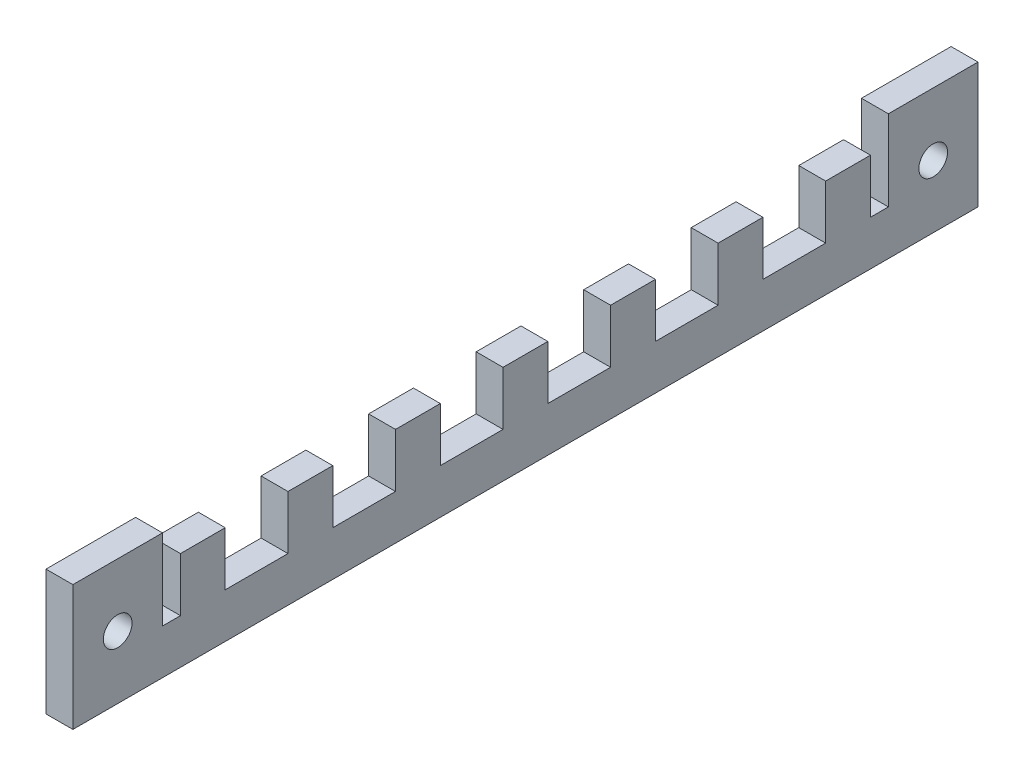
ISO-10303-21;
HEADER;
FILE_DESCRIPTION(('STEP AP214'),'2;1');
FILE_NAME('part.step','',(''),(''),'','','');
FILE_SCHEMA(('AUTOMOTIVE_DESIGN { 1 0 10303 214 1 1 1 1 }'));
ENDSEC;
DATA;
#1=APPLICATION_CONTEXT('core data for automotive mechanical design processes');
#2=APPLICATION_PROTOCOL_DEFINITION('international standard','automotive_design',2000,#1);
#3=PRODUCT_CONTEXT('',#1,'mechanical');
#4=PRODUCT('Part','Part','',(#3));
#5=PRODUCT_RELATED_PRODUCT_CATEGORY('part','',(#4));
#6=PRODUCT_DEFINITION_FORMATION('','',#4);
#7=PRODUCT_DEFINITION_CONTEXT('part definition',#1,'design');
#8=PRODUCT_DEFINITION('design','',#6,#7);
#9=PRODUCT_DEFINITION_SHAPE('','',#8);
#10=(LENGTH_UNIT() NAMED_UNIT(*) SI_UNIT(.MILLI.,.METRE.));
#11=(NAMED_UNIT(*) PLANE_ANGLE_UNIT() SI_UNIT($,.RADIAN.));
#12=(NAMED_UNIT(*) SI_UNIT($,.STERADIAN.) SOLID_ANGLE_UNIT());
#13=UNCERTAINTY_MEASURE_WITH_UNIT(LENGTH_MEASURE(1.E-05),#10,'distance_accuracy_value','');
#14=(GEOMETRIC_REPRESENTATION_CONTEXT(3) GLOBAL_UNCERTAINTY_ASSIGNED_CONTEXT((#13)) GLOBAL_UNIT_ASSIGNED_CONTEXT((#10,
#11,#12)) REPRESENTATION_CONTEXT('',''));
#15=CARTESIAN_POINT('',(0.,0.,0.));
#16=DIRECTION('',(0.,0.,1.));
#17=DIRECTION('',(1.,0.,0.));
#18=AXIS2_PLACEMENT_3D('',#15,#16,#17);
#19=CARTESIAN_POINT('',(22.5,24.4814087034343,-50.51));
#20=DIRECTION('',(-1.,0.,0.));
#21=DIRECTION('',(0.,0.,1.));
#22=AXIS2_PLACEMENT_3D('',#19,#20,#21);
#23=PLANE('',#22);
#24=CARTESIAN_POINT('',(22.5,7.,45.5));
#25=DIRECTION('',(-1.,0.,0.));
#26=DIRECTION('',(0.,0.,1.));
#27=AXIS2_PLACEMENT_3D('',#24,#25,#26);
#28=CIRCLE('',#27,1.6);
#29=CARTESIAN_POINT('',(22.5,7.,47.1));
#30=VERTEX_POINT('',#29);
#31=EDGE_CURVE('E404',#30,#30,#28,.F.);
#32=ORIENTED_EDGE('',*,*,#31,.F.);
#33=EDGE_LOOP('',(#32));
#34=FACE_BOUND('',#33,.T.);
#35=DIRECTION('',(0.,1.,0.));
#36=VECTOR('',#35,1.);
#37=CARTESIAN_POINT('',(22.5,14.,50.5));
#38=LINE('',#37,#36);
#39=CARTESIAN_POINT('',(22.5,0.,50.5));
#40=VERTEX_POINT('',#39);
#41=CARTESIAN_POINT('',(22.5,14.,50.5));
#42=VERTEX_POINT('',#41);
#43=EDGE_CURVE('E395',#40,#42,#38,.T.);
#44=ORIENTED_EDGE('',*,*,#43,.F.);
#45=DIRECTION('',(0.,0.,-1.));
#46=VECTOR('',#45,1.);
#47=CARTESIAN_POINT('',(22.5,0.,0.));
#48=LINE('',#47,#46);
#49=CARTESIAN_POINT('',(22.5,0.,-50.5));
#50=VERTEX_POINT('',#49);
#51=EDGE_CURVE('E386',#40,#50,#48,.T.);
#52=ORIENTED_EDGE('',*,*,#51,.T.);
#53=DIRECTION('',(0.,-1.,0.));
#54=VECTOR('',#53,1.);
#55=CARTESIAN_POINT('',(22.5,14.,-50.5));
#56=LINE('',#55,#54);
#57=CARTESIAN_POINT('',(22.5,14.,-50.5));
#58=VERTEX_POINT('',#57);
#59=EDGE_CURVE('E398',#58,#50,#56,.T.);
#60=ORIENTED_EDGE('',*,*,#59,.F.);
#61=DIRECTION('',(0.,0.,-1.));
#62=VECTOR('',#61,1.);
#63=CARTESIAN_POINT('',(22.5,14.,0.));
#64=LINE('',#63,#62);
#65=CARTESIAN_POINT('',(22.5,14.,-40.5));
#66=VERTEX_POINT('',#65);
#67=EDGE_CURVE('E393',#66,#58,#64,.T.);
#68=ORIENTED_EDGE('',*,*,#67,.F.);
#69=DIRECTION('',(0.,-1.,0.));
#70=VECTOR('',#69,1.);
#71=CARTESIAN_POINT('',(22.5,-4.,-40.5));
#72=LINE('',#71,#70);
#73=CARTESIAN_POINT('',(22.5,5.,-40.5));
#74=VERTEX_POINT('',#73);
#75=EDGE_CURVE('E353',#66,#74,#72,.T.);
#76=ORIENTED_EDGE('',*,*,#75,.T.);
#77=DIRECTION('',(0.,0.,-1.));
#78=VECTOR('',#77,1.);
#79=CARTESIAN_POINT('',(22.5,5.,-40.5));
#80=LINE('',#79,#78);
#81=CARTESIAN_POINT('',(22.5,5.,-38.5));
#82=VERTEX_POINT('',#81);
#83=EDGE_CURVE('E408',#82,#74,#80,.T.);
#84=ORIENTED_EDGE('',*,*,#83,.F.);
#85=DIRECTION('',(0.,1.,0.));
#86=VECTOR('',#85,1.);
#87=CARTESIAN_POINT('',(22.5,11.,-38.5));
#88=LINE('',#87,#86);
#89=CARTESIAN_POINT('',(22.5,11.,-38.5));
#90=VERTEX_POINT('',#89);
#91=EDGE_CURVE('E356',#82,#90,#88,.T.);
#92=ORIENTED_EDGE('',*,*,#91,.T.);
#93=DIRECTION('',(0.,0.,1.));
#94=VECTOR('',#93,1.);
#95=CARTESIAN_POINT('',(22.5,11.,-40.5));
#96=LINE('',#95,#94);
#97=CARTESIAN_POINT('',(22.5,11.,-33.5));
#98=VERTEX_POINT('',#97);
#99=EDGE_CURVE('E331',#90,#98,#96,.T.);
#100=ORIENTED_EDGE('',*,*,#99,.T.);
#101=DIRECTION('',(0.,-1.,0.));
#102=VECTOR('',#101,1.);
#103=CARTESIAN_POINT('',(22.5,11.,-33.5));
#104=LINE('',#103,#102);
#105=CARTESIAN_POINT('',(22.5,5.,-33.5));
#106=VERTEX_POINT('',#105);
#107=EDGE_CURVE('E359',#98,#106,#104,.T.);
#108=ORIENTED_EDGE('',*,*,#107,.T.);
#109=DIRECTION('',(0.,0.,1.));
#110=VECTOR('',#109,1.);
#111=CARTESIAN_POINT('',(22.5,5.,-38.5));
#112=LINE('',#111,#110);
#113=CARTESIAN_POINT('',(22.5,5.,-26.5));
#114=VERTEX_POINT('',#113);
#115=EDGE_CURVE('E318',#106,#114,#112,.T.);
#116=ORIENTED_EDGE('',*,*,#115,.T.);
#117=DIRECTION('',(0.,1.,0.));
#118=VECTOR('',#117,1.);
#119=CARTESIAN_POINT('',(22.5,11.,-26.5));
#120=LINE('',#119,#118);
#121=CARTESIAN_POINT('',(22.5,11.,-26.5));
#122=VERTEX_POINT('',#121);
#123=EDGE_CURVE('E363',#114,#122,#120,.T.);
#124=ORIENTED_EDGE('',*,*,#123,.T.);
#125=DIRECTION('',(0.,0.,1.));
#126=VECTOR('',#125,1.);
#127=CARTESIAN_POINT('',(22.5,11.,-28.5));
#128=LINE('',#127,#126);
#129=CARTESIAN_POINT('',(22.5,11.,-21.5));
#130=VERTEX_POINT('',#129);
#131=EDGE_CURVE('E334',#122,#130,#128,.T.);
#132=ORIENTED_EDGE('',*,*,#131,.T.);
#133=DIRECTION('',(0.,-1.,0.));
#134=VECTOR('',#133,1.);
#135=CARTESIAN_POINT('',(22.5,11.,-21.5));
#136=LINE('',#135,#134);
#137=CARTESIAN_POINT('',(22.5,5.,-21.5));
#138=VERTEX_POINT('',#137);
#139=EDGE_CURVE('E361',#130,#138,#136,.T.);
#140=ORIENTED_EDGE('',*,*,#139,.T.);
#141=DIRECTION('',(0.,0.,1.));
#142=VECTOR('',#141,1.);
#143=CARTESIAN_POINT('',(22.5,5.,-38.5));
#144=LINE('',#143,#142);
#145=CARTESIAN_POINT('',(22.5,5.,-14.5));
#146=VERTEX_POINT('',#145);
#147=EDGE_CURVE('E290',#138,#146,#144,.T.);
#148=ORIENTED_EDGE('',*,*,#147,.T.);
#149=DIRECTION('',(0.,1.,0.));
#150=VECTOR('',#149,1.);
#151=CARTESIAN_POINT('',(22.5,11.,-14.5));
#152=LINE('',#151,#150);
#153=CARTESIAN_POINT('',(22.5,11.,-14.5));
#154=VERTEX_POINT('',#153);
#155=EDGE_CURVE('E367',#146,#154,#152,.T.);
#156=ORIENTED_EDGE('',*,*,#155,.T.);
#157=DIRECTION('',(0.,0.,1.));
#158=VECTOR('',#157,1.);
#159=CARTESIAN_POINT('',(22.5,11.,-16.5));
#160=LINE('',#159,#158);
#161=CARTESIAN_POINT('',(22.5,11.,-9.5));
#162=VERTEX_POINT('',#161);
#163=EDGE_CURVE('E337',#154,#162,#160,.T.);
#164=ORIENTED_EDGE('',*,*,#163,.T.);
#165=DIRECTION('',(0.,-1.,0.));
#166=VECTOR('',#165,1.);
#167=CARTESIAN_POINT('',(22.5,11.,-9.5));
#168=LINE('',#167,#166);
#169=CARTESIAN_POINT('',(22.5,5.,-9.5));
#170=VERTEX_POINT('',#169);
#171=EDGE_CURVE('E285',#162,#170,#168,.T.);
#172=ORIENTED_EDGE('',*,*,#171,.T.);
#173=DIRECTION('',(0.,0.,1.));
#174=VECTOR('',#173,1.);
#175=CARTESIAN_POINT('',(22.5,5.,-38.5));
#176=LINE('',#175,#174);
#177=CARTESIAN_POINT('',(22.5,5.,-2.49999999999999));
#178=VERTEX_POINT('',#177);
#179=EDGE_CURVE('E281',#170,#178,#176,.T.);
#180=ORIENTED_EDGE('',*,*,#179,.T.);
#181=DIRECTION('',(0.,1.,0.));
#182=VECTOR('',#181,1.);
#183=CARTESIAN_POINT('',(22.5,11.,-2.49999999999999));
#184=LINE('',#183,#182);
#185=CARTESIAN_POINT('',(22.5,11.,-2.49999999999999));
#186=VERTEX_POINT('',#185);
#187=EDGE_CURVE('E267',#178,#186,#184,.T.);
#188=ORIENTED_EDGE('',*,*,#187,.T.);
#189=DIRECTION('',(0.,0.,1.));
#190=VECTOR('',#189,1.);
#191=CARTESIAN_POINT('',(22.5,11.,-4.49999999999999));
#192=LINE('',#191,#190);
#193=CARTESIAN_POINT('',(22.5,11.,2.5));
#194=VERTEX_POINT('',#193);
#195=EDGE_CURVE('E339',#186,#194,#192,.T.);
#196=ORIENTED_EDGE('',*,*,#195,.T.);
#197=DIRECTION('',(0.,-1.,0.));
#198=VECTOR('',#197,1.);
#199=CARTESIAN_POINT('',(22.5,11.,2.5));
#200=LINE('',#199,#198);
#201=CARTESIAN_POINT('',(22.5,5.,2.5));
#202=VERTEX_POINT('',#201);
#203=EDGE_CURVE('E278',#194,#202,#200,.T.);
#204=ORIENTED_EDGE('',*,*,#203,.T.);
#205=DIRECTION('',(0.,0.,1.));
#206=VECTOR('',#205,1.);
#207=CARTESIAN_POINT('',(22.5,5.,-38.5));
#208=LINE('',#207,#206);
#209=CARTESIAN_POINT('',(22.5,5.,9.50000000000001));
#210=VERTEX_POINT('',#209);
#211=EDGE_CURVE('E289',#202,#210,#208,.T.);
#212=ORIENTED_EDGE('',*,*,#211,.T.);
#213=DIRECTION('',(0.,1.,0.));
#214=VECTOR('',#213,1.);
#215=CARTESIAN_POINT('',(22.5,11.,9.50000000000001));
#216=LINE('',#215,#214);
#217=CARTESIAN_POINT('',(22.5,11.,9.50000000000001));
#218=VERTEX_POINT('',#217);
#219=EDGE_CURVE('E372',#210,#218,#216,.T.);
#220=ORIENTED_EDGE('',*,*,#219,.T.);
#221=DIRECTION('',(0.,0.,1.));
#222=VECTOR('',#221,1.);
#223=CARTESIAN_POINT('',(22.5,11.,7.50000000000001));
#224=LINE('',#223,#222);
#225=CARTESIAN_POINT('',(22.5,11.,14.5));
#226=VERTEX_POINT('',#225);
#227=EDGE_CURVE('E341',#218,#226,#224,.T.);
#228=ORIENTED_EDGE('',*,*,#227,.T.);
#229=DIRECTION('',(0.,-1.,0.));
#230=VECTOR('',#229,1.);
#231=CARTESIAN_POINT('',(22.5,11.,14.5));
#232=LINE('',#231,#230);
#233=CARTESIAN_POINT('',(22.5,5.,14.5));
#234=VERTEX_POINT('',#233);
#235=EDGE_CURVE('E277',#226,#234,#232,.T.);
#236=ORIENTED_EDGE('',*,*,#235,.T.);
#237=DIRECTION('',(0.,0.,1.));
#238=VECTOR('',#237,1.);
#239=CARTESIAN_POINT('',(22.5,5.,-38.5));
#240=LINE('',#239,#238);
#241=CARTESIAN_POINT('',(22.5,5.,21.5));
#242=VERTEX_POINT('',#241);
#243=EDGE_CURVE('E325',#234,#242,#240,.T.);
#244=ORIENTED_EDGE('',*,*,#243,.T.);
#245=DIRECTION('',(0.,1.,0.));
#246=VECTOR('',#245,1.);
#247=CARTESIAN_POINT('',(22.5,11.,21.5));
#248=LINE('',#247,#246);
#249=CARTESIAN_POINT('',(22.5,11.,21.5));
#250=VERTEX_POINT('',#249);
#251=EDGE_CURVE('E377',#242,#250,#248,.T.);
#252=ORIENTED_EDGE('',*,*,#251,.T.);
#253=DIRECTION('',(0.,0.,1.));
#254=VECTOR('',#253,1.);
#255=CARTESIAN_POINT('',(22.5,11.,19.5));
#256=LINE('',#255,#254);
#257=CARTESIAN_POINT('',(22.5,11.,26.5));
#258=VERTEX_POINT('',#257);
#259=EDGE_CURVE('E344',#250,#258,#256,.T.);
#260=ORIENTED_EDGE('',*,*,#259,.T.);
#261=DIRECTION('',(0.,-1.,0.));
#262=VECTOR('',#261,1.);
#263=CARTESIAN_POINT('',(22.5,11.,26.5));
#264=LINE('',#263,#262);
#265=CARTESIAN_POINT('',(22.5,5.,26.5));
#266=VERTEX_POINT('',#265);
#267=EDGE_CURVE('E375',#258,#266,#264,.T.);
#268=ORIENTED_EDGE('',*,*,#267,.T.);
#269=DIRECTION('',(0.,0.,1.));
#270=VECTOR('',#269,1.);
#271=CARTESIAN_POINT('',(22.5,5.,-38.5));
#272=LINE('',#271,#270);
#273=CARTESIAN_POINT('',(22.5,5.,33.5));
#274=VERTEX_POINT('',#273);
#275=EDGE_CURVE('E328',#266,#274,#272,.T.);
#276=ORIENTED_EDGE('',*,*,#275,.T.);
#277=DIRECTION('',(0.,1.,0.));
#278=VECTOR('',#277,1.);
#279=CARTESIAN_POINT('',(22.5,11.,33.5));
#280=LINE('',#279,#278);
#281=CARTESIAN_POINT('',(22.5,11.,33.5));
#282=VERTEX_POINT('',#281);
#283=EDGE_CURVE('E383',#274,#282,#280,.T.);
#284=ORIENTED_EDGE('',*,*,#283,.T.);
#285=DIRECTION('',(0.,0.,1.));
#286=VECTOR('',#285,1.);
#287=CARTESIAN_POINT('',(22.5,11.,31.5));
#288=LINE('',#287,#286);
#289=CARTESIAN_POINT('',(22.5,11.,38.5));
#290=VERTEX_POINT('',#289);
#291=EDGE_CURVE('E347',#282,#290,#288,.T.);
#292=ORIENTED_EDGE('',*,*,#291,.T.);
#293=DIRECTION('',(0.,-1.,0.));
#294=VECTOR('',#293,1.);
#295=CARTESIAN_POINT('',(22.5,11.,38.5));
#296=LINE('',#295,#294);
#297=CARTESIAN_POINT('',(22.5,5.,38.5));
#298=VERTEX_POINT('',#297);
#299=EDGE_CURVE('E380',#290,#298,#296,.T.);
#300=ORIENTED_EDGE('',*,*,#299,.T.);
#301=CARTESIAN_POINT('',(22.5,5.,40.5));
#302=VERTEX_POINT('',#301);
#303=EDGE_CURVE('E407',#302,#298,#80,.T.);
#304=ORIENTED_EDGE('',*,*,#303,.F.);
#305=DIRECTION('',(0.,1.,0.));
#306=VECTOR('',#305,1.);
#307=CARTESIAN_POINT('',(22.5,-4.,40.5));
#308=LINE('',#307,#306);
#309=CARTESIAN_POINT('',(22.5,14.,40.5));
#310=VERTEX_POINT('',#309);
#311=EDGE_CURVE('E350',#302,#310,#308,.T.);
#312=ORIENTED_EDGE('',*,*,#311,.T.);
#313=EDGE_CURVE('E391',#42,#310,#64,.T.);
#314=ORIENTED_EDGE('',*,*,#313,.F.);
#315=EDGE_LOOP('',(#44,#52,#60,#68,#76,#84,#92,#100,#108,#116,#124,#132,#140,#148,#156,#164,
#172,#180,#188,#196,#204,#212,#220,#228,#236,#244,#252,#260,#268,#276,#284,#292,#300,#304,#312,#314));
#316=FACE_BOUND('',#315,.T.);
#317=CARTESIAN_POINT('',(22.5,7.,-45.5));
#318=DIRECTION('',(-1.,0.,0.));
#319=DIRECTION('',(0.,0.,1.));
#320=AXIS2_PLACEMENT_3D('',#317,#318,#319);
#321=CIRCLE('',#320,1.6);
#322=CARTESIAN_POINT('',(22.5,7.,-43.9));
#323=VERTEX_POINT('',#322);
#324=EDGE_CURVE('E401',#323,#323,#321,.F.);
#325=ORIENTED_EDGE('',*,*,#324,.F.);
#326=EDGE_LOOP('',(#325));
#327=FACE_BOUND('',#326,.T.);
#328=ADVANCED_FACE('F32',(#34,#316,#327),#23,.F.);
#329=CARTESIAN_POINT('',(19.5,24.4814087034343,-50.51));
#330=DIRECTION('',(-1.,0.,0.));
#331=DIRECTION('',(0.,0.,1.));
#332=AXIS2_PLACEMENT_3D('',#329,#330,#331);
#333=PLANE('',#332);
#334=CARTESIAN_POINT('',(19.5,7.,-45.5));
#335=DIRECTION('',(-1.,0.,0.));
#336=DIRECTION('',(0.,0.,1.));
#337=AXIS2_PLACEMENT_3D('',#334,#335,#336);
#338=CIRCLE('',#337,1.6);
#339=CARTESIAN_POINT('',(19.5,7.,-43.9));
#340=VERTEX_POINT('',#339);
#341=EDGE_CURVE('E390',#340,#340,#338,.F.);
#342=ORIENTED_EDGE('',*,*,#341,.T.);
#343=EDGE_LOOP('',(#342));
#344=FACE_BOUND('',#343,.T.);
#345=DIRECTION('',(0.,1.,0.));
#346=VECTOR('',#345,1.);
#347=CARTESIAN_POINT('',(19.5,14.,50.5));
#348=LINE('',#347,#346);
#349=CARTESIAN_POINT('',(19.5,0.,50.5));
#350=VERTEX_POINT('',#349);
#351=CARTESIAN_POINT('',(19.5,14.,50.5));
#352=VERTEX_POINT('',#351);
#353=EDGE_CURVE('E487',#350,#352,#348,.T.);
#354=ORIENTED_EDGE('',*,*,#353,.T.);
#355=DIRECTION('',(0.,0.,-1.));
#356=VECTOR('',#355,1.);
#357=CARTESIAN_POINT('',(19.5,14.,0.));
#358=LINE('',#357,#356);
#359=CARTESIAN_POINT('',(19.5,14.,40.5));
#360=VERTEX_POINT('',#359);
#361=EDGE_CURVE('E394',#352,#360,#358,.T.);
#362=ORIENTED_EDGE('',*,*,#361,.T.);
#363=DIRECTION('',(0.,1.,0.));
#364=VECTOR('',#363,1.);
#365=CARTESIAN_POINT('',(19.5,-4.,40.5));
#366=LINE('',#365,#364);
#367=CARTESIAN_POINT('',(19.5,5.,40.5));
#368=VERTEX_POINT('',#367);
#369=EDGE_CURVE('E574',#368,#360,#366,.T.);
#370=ORIENTED_EDGE('',*,*,#369,.F.);
#371=DIRECTION('',(0.,0.,-1.));
#372=VECTOR('',#371,1.);
#373=CARTESIAN_POINT('',(19.5,5.,-40.5));
#374=LINE('',#373,#372);
#375=CARTESIAN_POINT('',(19.5,5.,38.5));
#376=VERTEX_POINT('',#375);
#377=EDGE_CURVE('E495',#368,#376,#374,.T.);
#378=ORIENTED_EDGE('',*,*,#377,.T.);
#379=DIRECTION('',(0.,-1.,0.));
#380=VECTOR('',#379,1.);
#381=CARTESIAN_POINT('',(19.5,11.,38.5));
#382=LINE('',#381,#380);
#383=CARTESIAN_POINT('',(19.5,11.,38.5));
#384=VERTEX_POINT('',#383);
#385=EDGE_CURVE('E630',#384,#376,#382,.T.);
#386=ORIENTED_EDGE('',*,*,#385,.F.);
#387=DIRECTION('',(0.,0.,1.));
#388=VECTOR('',#387,1.);
#389=CARTESIAN_POINT('',(19.5,11.,31.5));
#390=LINE('',#389,#388);
#391=CARTESIAN_POINT('',(19.5,11.,33.5));
#392=VERTEX_POINT('',#391);
#393=EDGE_CURVE('E548',#392,#384,#390,.T.);
#394=ORIENTED_EDGE('',*,*,#393,.F.);
#395=DIRECTION('',(0.,1.,0.));
#396=VECTOR('',#395,1.);
#397=CARTESIAN_POINT('',(19.5,11.,33.5));
#398=LINE('',#397,#396);
#399=CARTESIAN_POINT('',(19.5,5.,33.5));
#400=VERTEX_POINT('',#399);
#401=EDGE_CURVE('E631',#400,#392,#398,.T.);
#402=ORIENTED_EDGE('',*,*,#401,.F.);
#403=CARTESIAN_POINT('',(19.5,5.,26.5));
#404=VERTEX_POINT('',#403);
#405=EDGE_CURVE('E499',#400,#404,#374,.T.);
#406=ORIENTED_EDGE('',*,*,#405,.T.);
#407=DIRECTION('',(0.,-1.,0.));
#408=VECTOR('',#407,1.);
#409=CARTESIAN_POINT('',(19.5,11.,26.5));
#410=LINE('',#409,#408);
#411=CARTESIAN_POINT('',(19.5,11.,26.5));
#412=VERTEX_POINT('',#411);
#413=EDGE_CURVE('E553',#412,#404,#410,.T.);
#414=ORIENTED_EDGE('',*,*,#413,.F.);
#415=DIRECTION('',(0.,0.,1.));
#416=VECTOR('',#415,1.);
#417=CARTESIAN_POINT('',(19.5,11.,19.5));
#418=LINE('',#417,#416);
#419=CARTESIAN_POINT('',(19.5,11.,21.5));
#420=VERTEX_POINT('',#419);
#421=EDGE_CURVE('E544',#420,#412,#418,.T.);
#422=ORIENTED_EDGE('',*,*,#421,.F.);
#423=DIRECTION('',(0.,1.,0.));
#424=VECTOR('',#423,1.);
#425=CARTESIAN_POINT('',(19.5,11.,21.5));
#426=LINE('',#425,#424);
#427=CARTESIAN_POINT('',(19.5,5.,21.5));
#428=VERTEX_POINT('',#427);
#429=EDGE_CURVE('E526',#428,#420,#426,.T.);
#430=ORIENTED_EDGE('',*,*,#429,.F.);
#431=CARTESIAN_POINT('',(19.5,5.,14.5));
#432=VERTEX_POINT('',#431);
#433=EDGE_CURVE('E503',#428,#432,#374,.T.);
#434=ORIENTED_EDGE('',*,*,#433,.T.);
#435=DIRECTION('',(0.,-1.,0.));
#436=VECTOR('',#435,1.);
#437=CARTESIAN_POINT('',(19.5,11.,14.5));
#438=LINE('',#437,#436);
#439=CARTESIAN_POINT('',(19.5,11.,14.5));
#440=VERTEX_POINT('',#439);
#441=EDGE_CURVE('E524',#440,#432,#438,.T.);
#442=ORIENTED_EDGE('',*,*,#441,.F.);
#443=DIRECTION('',(0.,0.,1.));
#444=VECTOR('',#443,1.);
#445=CARTESIAN_POINT('',(19.5,11.,7.50000000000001));
#446=LINE('',#445,#444);
#447=CARTESIAN_POINT('',(19.5,11.,9.50000000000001));
#448=VERTEX_POINT('',#447);
#449=EDGE_CURVE('E541',#448,#440,#446,.T.);
#450=ORIENTED_EDGE('',*,*,#449,.F.);
#451=DIRECTION('',(0.,1.,0.));
#452=VECTOR('',#451,1.);
#453=CARTESIAN_POINT('',(19.5,11.,9.50000000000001));
#454=LINE('',#453,#452);
#455=CARTESIAN_POINT('',(19.5,5.,9.50000000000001));
#456=VERTEX_POINT('',#455);
#457=EDGE_CURVE('E534',#456,#448,#454,.T.);
#458=ORIENTED_EDGE('',*,*,#457,.F.);
#459=CARTESIAN_POINT('',(19.5,5.,2.5));
#460=VERTEX_POINT('',#459);
#461=EDGE_CURVE('E514',#456,#460,#374,.T.);
#462=ORIENTED_EDGE('',*,*,#461,.T.);
#463=DIRECTION('',(0.,-1.,0.));
#464=VECTOR('',#463,1.);
#465=CARTESIAN_POINT('',(19.5,11.,2.5));
#466=LINE('',#465,#464);
#467=CARTESIAN_POINT('',(19.5,11.,2.5));
#468=VERTEX_POINT('',#467);
#469=EDGE_CURVE('E554',#468,#460,#466,.T.);
#470=ORIENTED_EDGE('',*,*,#469,.F.);
#471=DIRECTION('',(0.,0.,1.));
#472=VECTOR('',#471,1.);
#473=CARTESIAN_POINT('',(19.5,11.,-4.49999999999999));
#474=LINE('',#473,#472);
#475=CARTESIAN_POINT('',(19.5,11.,-2.49999999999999));
#476=VERTEX_POINT('',#475);
#477=EDGE_CURVE('E543',#476,#468,#474,.T.);
#478=ORIENTED_EDGE('',*,*,#477,.F.);
#479=DIRECTION('',(0.,1.,0.));
#480=VECTOR('',#479,1.);
#481=CARTESIAN_POINT('',(19.5,11.,-2.49999999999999));
#482=LINE('',#481,#480);
#483=CARTESIAN_POINT('',(19.5,5.,-2.49999999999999));
#484=VERTEX_POINT('',#483);
#485=EDGE_CURVE('E533',#484,#476,#482,.T.);
#486=ORIENTED_EDGE('',*,*,#485,.F.);
#487=CARTESIAN_POINT('',(19.5,5.,-9.5));
#488=VERTEX_POINT('',#487);
#489=EDGE_CURVE('E294',#484,#488,#374,.T.);
#490=ORIENTED_EDGE('',*,*,#489,.T.);
#491=DIRECTION('',(0.,-1.,0.));
#492=VECTOR('',#491,1.);
#493=CARTESIAN_POINT('',(19.5,11.,-9.5));
#494=LINE('',#493,#492);
#495=CARTESIAN_POINT('',(19.5,11.,-9.5));
#496=VERTEX_POINT('',#495);
#497=EDGE_CURVE('E558',#496,#488,#494,.T.);
#498=ORIENTED_EDGE('',*,*,#497,.F.);
#499=DIRECTION('',(0.,0.,1.));
#500=VECTOR('',#499,1.);
#501=CARTESIAN_POINT('',(19.5,11.,-16.5));
#502=LINE('',#501,#500);
#503=CARTESIAN_POINT('',(19.5,11.,-14.5));
#504=VERTEX_POINT('',#503);
#505=EDGE_CURVE('E546',#504,#496,#502,.T.);
#506=ORIENTED_EDGE('',*,*,#505,.F.);
#507=DIRECTION('',(0.,1.,0.));
#508=VECTOR('',#507,1.);
#509=CARTESIAN_POINT('',(19.5,11.,-14.5));
#510=LINE('',#509,#508);
#511=CARTESIAN_POINT('',(19.5,5.,-14.5));
#512=VERTEX_POINT('',#511);
#513=EDGE_CURVE('E555',#512,#504,#510,.T.);
#514=ORIENTED_EDGE('',*,*,#513,.F.);
#515=CARTESIAN_POINT('',(19.5,5.,-21.5));
#516=VERTEX_POINT('',#515);
#517=EDGE_CURVE('E508',#512,#516,#374,.T.);
#518=ORIENTED_EDGE('',*,*,#517,.T.);
#519=DIRECTION('',(0.,-1.,0.));
#520=VECTOR('',#519,1.);
#521=CARTESIAN_POINT('',(19.5,11.,-21.5));
#522=LINE('',#521,#520);
#523=CARTESIAN_POINT('',(19.5,11.,-21.5));
#524=VERTEX_POINT('',#523);
#525=EDGE_CURVE('E566',#524,#516,#522,.T.);
#526=ORIENTED_EDGE('',*,*,#525,.F.);
#527=DIRECTION('',(0.,0.,1.));
#528=VECTOR('',#527,1.);
#529=CARTESIAN_POINT('',(19.5,11.,-28.5));
#530=LINE('',#529,#528);
#531=CARTESIAN_POINT('',(19.5,11.,-26.5));
#532=VERTEX_POINT('',#531);
#533=EDGE_CURVE('E562',#532,#524,#530,.T.);
#534=ORIENTED_EDGE('',*,*,#533,.F.);
#535=DIRECTION('',(0.,1.,0.));
#536=VECTOR('',#535,1.);
#537=CARTESIAN_POINT('',(19.5,11.,-26.5));
#538=LINE('',#537,#536);
#539=CARTESIAN_POINT('',(19.5,5.,-26.5));
#540=VERTEX_POINT('',#539);
#541=EDGE_CURVE('E560',#540,#532,#538,.T.);
#542=ORIENTED_EDGE('',*,*,#541,.F.);
#543=CARTESIAN_POINT('',(19.5,5.,-33.5));
#544=VERTEX_POINT('',#543);
#545=EDGE_CURVE('E505',#540,#544,#374,.T.);
#546=ORIENTED_EDGE('',*,*,#545,.T.);
#547=DIRECTION('',(0.,-1.,0.));
#548=VECTOR('',#547,1.);
#549=CARTESIAN_POINT('',(19.5,11.,-33.5));
#550=LINE('',#549,#548);
#551=CARTESIAN_POINT('',(19.5,11.,-33.5));
#552=VERTEX_POINT('',#551);
#553=EDGE_CURVE('E568',#552,#544,#550,.T.);
#554=ORIENTED_EDGE('',*,*,#553,.F.);
#555=DIRECTION('',(0.,0.,1.));
#556=VECTOR('',#555,1.);
#557=CARTESIAN_POINT('',(19.5,11.,-40.5));
#558=LINE('',#557,#556);
#559=CARTESIAN_POINT('',(19.5,11.,-38.5));
#560=VERTEX_POINT('',#559);
#561=EDGE_CURVE('E49',#560,#552,#558,.T.);
#562=ORIENTED_EDGE('',*,*,#561,.F.);
#563=DIRECTION('',(0.,1.,0.));
#564=VECTOR('',#563,1.);
#565=CARTESIAN_POINT('',(19.5,11.,-38.5));
#566=LINE('',#565,#564);
#567=CARTESIAN_POINT('',(19.5,5.,-38.5));
#568=VERTEX_POINT('',#567);
#569=EDGE_CURVE('E575',#568,#560,#566,.T.);
#570=ORIENTED_EDGE('',*,*,#569,.F.);
#571=CARTESIAN_POINT('',(19.5,5.,-40.5));
#572=VERTEX_POINT('',#571);
#573=EDGE_CURVE('E36',#568,#572,#374,.T.);
#574=ORIENTED_EDGE('',*,*,#573,.T.);
#575=DIRECTION('',(0.,-1.,0.));
#576=VECTOR('',#575,1.);
#577=CARTESIAN_POINT('',(19.5,-4.,-40.5));
#578=LINE('',#577,#576);
#579=CARTESIAN_POINT('',(19.5,14.,-40.5));
#580=VERTEX_POINT('',#579);
#581=EDGE_CURVE('E572',#580,#572,#578,.T.);
#582=ORIENTED_EDGE('',*,*,#581,.F.);
#583=CARTESIAN_POINT('',(19.5,14.,-50.5));
#584=VERTEX_POINT('',#583);
#585=EDGE_CURVE('E484',#580,#584,#358,.T.);
#586=ORIENTED_EDGE('',*,*,#585,.T.);
#587=DIRECTION('',(0.,-1.,0.));
#588=VECTOR('',#587,1.);
#589=CARTESIAN_POINT('',(19.5,14.,-50.5));
#590=LINE('',#589,#588);
#591=CARTESIAN_POINT('',(19.5,0.,-50.5));
#592=VERTEX_POINT('',#591);
#593=EDGE_CURVE('E389',#584,#592,#590,.T.);
#594=ORIENTED_EDGE('',*,*,#593,.T.);
#595=DIRECTION('',(0.,0.,-1.));
#596=VECTOR('',#595,1.);
#597=CARTESIAN_POINT('',(19.5,0.,0.));
#598=LINE('',#597,#596);
#599=EDGE_CURVE('E400',#350,#592,#598,.T.);
#600=ORIENTED_EDGE('',*,*,#599,.F.);
#601=EDGE_LOOP('',(#354,#362,#370,#378,#386,#394,#402,#406,#414,#422,#430,#434,#442,#450,#458,
#462,#470,#478,#486,#490,#498,#506,#514,#518,#526,#534,#542,#546,#554,#562,#570,#574,#582,#586,
#594,#600));
#602=FACE_BOUND('',#601,.T.);
#603=CARTESIAN_POINT('',(19.5,7.,45.5));
#604=DIRECTION('',(-1.,0.,0.));
#605=DIRECTION('',(0.,0.,1.));
#606=AXIS2_PLACEMENT_3D('',#603,#604,#605);
#607=CIRCLE('',#606,1.6);
#608=CARTESIAN_POINT('',(19.5,7.,47.1));
#609=VERTEX_POINT('',#608);
#610=EDGE_CURVE('E493',#609,#609,#607,.F.);
#611=ORIENTED_EDGE('',*,*,#610,.T.);
#612=EDGE_LOOP('',(#611));
#613=FACE_BOUND('',#612,.T.);
#614=ADVANCED_FACE('F523',(#344,#602,#613),#333,.T.);
#615=CARTESIAN_POINT('',(0.,14.,0.));
#616=DIRECTION('',(0.,-1.,0.));
#617=DIRECTION('',(0.,0.,-1.));
#618=AXIS2_PLACEMENT_3D('',#615,#616,#617);
#619=PLANE('',#618);
#620=ORIENTED_EDGE('',*,*,#361,.F.);
#621=DIRECTION('',(1.,0.,0.));
#622=VECTOR('',#621,1.);
#623=CARTESIAN_POINT('',(-34.5,14.,50.5));
#624=LINE('',#623,#622);
#625=EDGE_CURVE('E479',#352,#42,#624,.T.);
#626=ORIENTED_EDGE('',*,*,#625,.T.);
#627=ORIENTED_EDGE('',*,*,#313,.T.);
#628=DIRECTION('',(-1.,0.,0.));
#629=VECTOR('',#628,1.);
#630=CARTESIAN_POINT('',(1.49999999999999,14.,40.5));
#631=LINE('',#630,#629);
#632=EDGE_CURVE('E317',#310,#360,#631,.T.);
#633=ORIENTED_EDGE('',*,*,#632,.T.);
#634=EDGE_LOOP('',(#620,#626,#627,#633));
#635=FACE_BOUND('',#634,.T.);
#636=ADVANCED_FACE('F618',(#635),#619,.F.);
#637=CARTESIAN_POINT('',(31.5,5.,-40.5));
#638=DIRECTION('',(0.,-1.,0.));
#639=DIRECTION('',(1.,0.,0.));
#640=AXIS2_PLACEMENT_3D('',#637,#638,#639);
#641=PLANE('',#640);
#642=ORIENTED_EDGE('',*,*,#377,.F.);
#643=DIRECTION('',(-1.,0.,0.));
#644=VECTOR('',#643,1.);
#645=CARTESIAN_POINT('',(1.49999999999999,5.,40.5));
#646=LINE('',#645,#644);
#647=EDGE_CURVE('E11',#302,#368,#646,.T.);
#648=ORIENTED_EDGE('',*,*,#647,.F.);
#649=ORIENTED_EDGE('',*,*,#303,.T.);
#650=DIRECTION('',(1.,0.,0.));
#651=VECTOR('',#650,1.);
#652=CARTESIAN_POINT('',(25.5,5.,38.5));
#653=LINE('',#652,#651);
#654=EDGE_CURVE('E313',#376,#298,#653,.T.);
#655=ORIENTED_EDGE('',*,*,#654,.F.);
#656=EDGE_LOOP('',(#642,#648,#649,#655));
#657=FACE_BOUND('',#656,.T.);
#658=ADVANCED_FACE('F624',(#657),#641,.F.);
#659=CARTESIAN_POINT('',(1.49999999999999,-4.,40.5));
#660=DIRECTION('',(0.,0.,-1.));
#661=DIRECTION('',(1.,0.,0.));
#662=AXIS2_PLACEMENT_3D('',#659,#660,#661);
#663=PLANE('',#662);
#664=ORIENTED_EDGE('',*,*,#647,.T.);
#665=ORIENTED_EDGE('',*,*,#369,.T.);
#666=ORIENTED_EDGE('',*,*,#632,.F.);
#667=ORIENTED_EDGE('',*,*,#311,.F.);
#668=EDGE_LOOP('',(#664,#665,#666,#667));
#669=FACE_BOUND('',#668,.T.);
#670=ADVANCED_FACE('F625',(#669),#663,.T.);
#671=ORIENTED_EDGE('',*,*,#573,.F.);
#672=DIRECTION('',(-1.,0.,0.));
#673=VECTOR('',#672,1.);
#674=CARTESIAN_POINT('',(25.5,5.,-38.5));
#675=LINE('',#674,#673);
#676=EDGE_CURVE('E412',#82,#568,#675,.T.);
#677=ORIENTED_EDGE('',*,*,#676,.F.);
#678=ORIENTED_EDGE('',*,*,#83,.T.);
#679=DIRECTION('',(1.,0.,0.));
#680=VECTOR('',#679,1.);
#681=CARTESIAN_POINT('',(31.5,5.,-40.5));
#682=LINE('',#681,#680);
#683=EDGE_CURVE('E41',#572,#74,#682,.T.);
#684=ORIENTED_EDGE('',*,*,#683,.F.);
#685=EDGE_LOOP('',(#671,#677,#678,#684));
#686=FACE_BOUND('',#685,.T.);
#687=ADVANCED_FACE('F595',(#686),#641,.F.);
#688=ORIENTED_EDGE('',*,*,#585,.F.);
#689=DIRECTION('',(1.,0.,0.));
#690=VECTOR('',#689,1.);
#691=CARTESIAN_POINT('',(31.5,14.,-40.5));
#692=LINE('',#691,#690);
#693=EDGE_CURVE('E430',#580,#66,#692,.T.);
#694=ORIENTED_EDGE('',*,*,#693,.T.);
#695=ORIENTED_EDGE('',*,*,#67,.T.);
#696=DIRECTION('',(-1.,0.,0.));
#697=VECTOR('',#696,1.);
#698=CARTESIAN_POINT('',(-34.5,14.,-50.5));
#699=LINE('',#698,#697);
#700=EDGE_CURVE('E482',#58,#584,#699,.T.);
#701=ORIENTED_EDGE('',*,*,#700,.T.);
#702=EDGE_LOOP('',(#688,#694,#695,#701));
#703=FACE_BOUND('',#702,.T.);
#704=ADVANCED_FACE('F603',(#703),#619,.F.);
#705=CARTESIAN_POINT('',(31.5,-4.,-40.5));
#706=DIRECTION('',(0.,0.,1.));
#707=DIRECTION('',(-1.,0.,0.));
#708=AXIS2_PLACEMENT_3D('',#705,#706,#707);
#709=PLANE('',#708);
#710=ORIENTED_EDGE('',*,*,#693,.F.);
#711=ORIENTED_EDGE('',*,*,#581,.T.);
#712=ORIENTED_EDGE('',*,*,#683,.T.);
#713=ORIENTED_EDGE('',*,*,#75,.F.);
#714=EDGE_LOOP('',(#710,#711,#712,#713));
#715=FACE_BOUND('',#714,.T.);
#716=ADVANCED_FACE('F598',(#715),#709,.T.);
#717=CARTESIAN_POINT('',(25.5,11.,-33.5));
#718=DIRECTION('',(0.,0.,1.));
#719=DIRECTION('',(-1.,0.,0.));
#720=AXIS2_PLACEMENT_3D('',#717,#718,#719);
#721=PLANE('',#720);
#722=DIRECTION('',(-1.,0.,0.));
#723=VECTOR('',#722,1.);
#724=CARTESIAN_POINT('',(25.5,11.,-33.5));
#725=LINE('',#724,#723);
#726=EDGE_CURVE('E433',#98,#552,#725,.T.);
#727=ORIENTED_EDGE('',*,*,#726,.T.);
#728=ORIENTED_EDGE('',*,*,#553,.T.);
#729=DIRECTION('',(1.,0.,0.));
#730=VECTOR('',#729,1.);
#731=CARTESIAN_POINT('',(25.5,5.,-33.5));
#732=LINE('',#731,#730);
#733=EDGE_CURVE('E415',#544,#106,#732,.T.);
#734=ORIENTED_EDGE('',*,*,#733,.T.);
#735=ORIENTED_EDGE('',*,*,#107,.F.);
#736=EDGE_LOOP('',(#727,#728,#734,#735));
#737=FACE_BOUND('',#736,.T.);
#738=ADVANCED_FACE('F588',(#737),#721,.T.);
#739=CARTESIAN_POINT('',(25.5,11.,-38.5));
#740=DIRECTION('',(0.,0.,-1.));
#741=DIRECTION('',(1.,0.,0.));
#742=AXIS2_PLACEMENT_3D('',#739,#740,#741);
#743=PLANE('',#742);
#744=ORIENTED_EDGE('',*,*,#676,.T.);
#745=ORIENTED_EDGE('',*,*,#569,.T.);
#746=DIRECTION('',(1.,0.,0.));
#747=VECTOR('',#746,1.);
#748=CARTESIAN_POINT('',(25.5,11.,-38.5));
#749=LINE('',#748,#747);
#750=EDGE_CURVE('E436',#560,#90,#749,.T.);
#751=ORIENTED_EDGE('',*,*,#750,.T.);
#752=ORIENTED_EDGE('',*,*,#91,.F.);
#753=EDGE_LOOP('',(#744,#745,#751,#752));
#754=FACE_BOUND('',#753,.T.);
#755=ADVANCED_FACE('F593',(#754),#743,.T.);
#756=CARTESIAN_POINT('',(31.5,11.,-40.5));
#757=DIRECTION('',(0.,1.,0.));
#758=DIRECTION('',(-1.,0.,0.));
#759=AXIS2_PLACEMENT_3D('',#756,#757,#758);
#760=PLANE('',#759);
#761=ORIENTED_EDGE('',*,*,#750,.F.);
#762=ORIENTED_EDGE('',*,*,#561,.T.);
#763=ORIENTED_EDGE('',*,*,#726,.F.);
#764=ORIENTED_EDGE('',*,*,#99,.F.);
#765=EDGE_LOOP('',(#761,#762,#763,#764));
#766=FACE_BOUND('',#765,.T.);
#767=ADVANCED_FACE('F589',(#766),#760,.T.);
#768=CARTESIAN_POINT('',(25.5,11.,-21.5));
#769=DIRECTION('',(0.,0.,1.));
#770=DIRECTION('',(-1.,0.,0.));
#771=AXIS2_PLACEMENT_3D('',#768,#769,#770);
#772=PLANE('',#771);
#773=DIRECTION('',(-1.,0.,0.));
#774=VECTOR('',#773,1.);
#775=CARTESIAN_POINT('',(25.5,11.,-21.5));
#776=LINE('',#775,#774);
#777=EDGE_CURVE('E439',#130,#524,#776,.T.);
#778=ORIENTED_EDGE('',*,*,#777,.T.);
#779=ORIENTED_EDGE('',*,*,#525,.T.);
#780=DIRECTION('',(1.,0.,0.));
#781=VECTOR('',#780,1.);
#782=CARTESIAN_POINT('',(25.5,5.,-21.5));
#783=LINE('',#782,#781);
#784=EDGE_CURVE('E418',#516,#138,#783,.T.);
#785=ORIENTED_EDGE('',*,*,#784,.T.);
#786=ORIENTED_EDGE('',*,*,#139,.F.);
#787=EDGE_LOOP('',(#778,#779,#785,#786));
#788=FACE_BOUND('',#787,.T.);
#789=ADVANCED_FACE('F686',(#788),#772,.T.);
#790=CARTESIAN_POINT('',(25.5,11.,-26.5));
#791=DIRECTION('',(0.,0.,-1.));
#792=DIRECTION('',(1.,0.,0.));
#793=AXIS2_PLACEMENT_3D('',#790,#791,#792);
#794=PLANE('',#793);
#795=DIRECTION('',(-1.,0.,0.));
#796=VECTOR('',#795,1.);
#797=CARTESIAN_POINT('',(25.5,5.,-26.5));
#798=LINE('',#797,#796);
#799=EDGE_CURVE('E421',#114,#540,#798,.T.);
#800=ORIENTED_EDGE('',*,*,#799,.T.);
#801=ORIENTED_EDGE('',*,*,#541,.T.);
#802=DIRECTION('',(1.,0.,0.));
#803=VECTOR('',#802,1.);
#804=CARTESIAN_POINT('',(25.5,11.,-26.5));
#805=LINE('',#804,#803);
#806=EDGE_CURVE('E442',#532,#122,#805,.T.);
#807=ORIENTED_EDGE('',*,*,#806,.T.);
#808=ORIENTED_EDGE('',*,*,#123,.F.);
#809=EDGE_LOOP('',(#800,#801,#807,#808));
#810=FACE_BOUND('',#809,.T.);
#811=ADVANCED_FACE('F581',(#810),#794,.T.);
#812=CARTESIAN_POINT('',(31.5,11.,-28.5));
#813=DIRECTION('',(0.,1.,0.));
#814=DIRECTION('',(-1.,0.,0.));
#815=AXIS2_PLACEMENT_3D('',#812,#813,#814);
#816=PLANE('',#815);
#817=ORIENTED_EDGE('',*,*,#806,.F.);
#818=ORIENTED_EDGE('',*,*,#533,.T.);
#819=ORIENTED_EDGE('',*,*,#777,.F.);
#820=ORIENTED_EDGE('',*,*,#131,.F.);
#821=EDGE_LOOP('',(#817,#818,#819,#820));
#822=FACE_BOUND('',#821,.T.);
#823=ADVANCED_FACE('F692',(#822),#816,.T.);
#824=CARTESIAN_POINT('',(25.5,11.,-9.5));
#825=DIRECTION('',(0.,0.,1.));
#826=DIRECTION('',(-1.,0.,0.));
#827=AXIS2_PLACEMENT_3D('',#824,#825,#826);
#828=PLANE('',#827);
#829=DIRECTION('',(-1.,0.,0.));
#830=VECTOR('',#829,1.);
#831=CARTESIAN_POINT('',(25.5,11.,-9.5));
#832=LINE('',#831,#830);
#833=EDGE_CURVE('E445',#162,#496,#832,.T.);
#834=ORIENTED_EDGE('',*,*,#833,.T.);
#835=ORIENTED_EDGE('',*,*,#497,.T.);
#836=DIRECTION('',(1.,0.,0.));
#837=VECTOR('',#836,1.);
#838=CARTESIAN_POINT('',(25.5,5.,-9.5));
#839=LINE('',#838,#837);
#840=EDGE_CURVE('E422',#488,#170,#839,.T.);
#841=ORIENTED_EDGE('',*,*,#840,.T.);
#842=ORIENTED_EDGE('',*,*,#171,.F.);
#843=EDGE_LOOP('',(#834,#835,#841,#842));
#844=FACE_BOUND('',#843,.T.);
#845=ADVANCED_FACE('F695',(#844),#828,.T.);
#846=CARTESIAN_POINT('',(25.5,11.,-14.5));
#847=DIRECTION('',(0.,0.,-1.));
#848=DIRECTION('',(1.,0.,0.));
#849=AXIS2_PLACEMENT_3D('',#846,#847,#848);
#850=PLANE('',#849);
#851=DIRECTION('',(-1.,0.,0.));
#852=VECTOR('',#851,1.);
#853=CARTESIAN_POINT('',(25.5,5.,-14.5));
#854=LINE('',#853,#852);
#855=EDGE_CURVE('E299',#146,#512,#854,.T.);
#856=ORIENTED_EDGE('',*,*,#855,.T.);
#857=ORIENTED_EDGE('',*,*,#513,.T.);
#858=DIRECTION('',(1.,0.,0.));
#859=VECTOR('',#858,1.);
#860=CARTESIAN_POINT('',(25.5,11.,-14.5));
#861=LINE('',#860,#859);
#862=EDGE_CURVE('E448',#504,#154,#861,.T.);
#863=ORIENTED_EDGE('',*,*,#862,.T.);
#864=ORIENTED_EDGE('',*,*,#155,.F.);
#865=EDGE_LOOP('',(#856,#857,#863,#864));
#866=FACE_BOUND('',#865,.T.);
#867=ADVANCED_FACE('F699',(#866),#850,.T.);
#868=CARTESIAN_POINT('',(31.5,11.,-16.5));
#869=DIRECTION('',(0.,1.,0.));
#870=DIRECTION('',(-1.,0.,0.));
#871=AXIS2_PLACEMENT_3D('',#868,#869,#870);
#872=PLANE('',#871);
#873=ORIENTED_EDGE('',*,*,#862,.F.);
#874=ORIENTED_EDGE('',*,*,#505,.T.);
#875=ORIENTED_EDGE('',*,*,#833,.F.);
#876=ORIENTED_EDGE('',*,*,#163,.F.);
#877=EDGE_LOOP('',(#873,#874,#875,#876));
#878=FACE_BOUND('',#877,.T.);
#879=ADVANCED_FACE('F703',(#878),#872,.T.);
#880=ORIENTED_EDGE('',*,*,#517,.F.);
#881=ORIENTED_EDGE('',*,*,#855,.F.);
#882=ORIENTED_EDGE('',*,*,#147,.F.);
#883=ORIENTED_EDGE('',*,*,#784,.F.);
#884=EDGE_LOOP('',(#880,#881,#882,#883));
#885=FACE_BOUND('',#884,.T.);
#886=ADVANCED_FACE('F707',(#885),#641,.F.);
#887=CARTESIAN_POINT('',(25.5,11.,2.5));
#888=DIRECTION('',(0.,0.,1.));
#889=DIRECTION('',(-1.,0.,0.));
#890=AXIS2_PLACEMENT_3D('',#887,#888,#889);
#891=PLANE('',#890);
#892=DIRECTION('',(-1.,0.,0.));
#893=VECTOR('',#892,1.);
#894=CARTESIAN_POINT('',(25.5,11.,2.5));
#895=LINE('',#894,#893);
#896=EDGE_CURVE('E451',#194,#468,#895,.T.);
#897=ORIENTED_EDGE('',*,*,#896,.T.);
#898=ORIENTED_EDGE('',*,*,#469,.T.);
#899=DIRECTION('',(1.,0.,0.));
#900=VECTOR('',#899,1.);
#901=CARTESIAN_POINT('',(25.5,5.,2.5));
#902=LINE('',#901,#900);
#903=EDGE_CURVE('E295',#460,#202,#902,.T.);
#904=ORIENTED_EDGE('',*,*,#903,.T.);
#905=ORIENTED_EDGE('',*,*,#203,.F.);
#906=EDGE_LOOP('',(#897,#898,#904,#905));
#907=FACE_BOUND('',#906,.T.);
#908=ADVANCED_FACE('F709',(#907),#891,.T.);
#909=CARTESIAN_POINT('',(25.5,11.,-2.49999999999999));
#910=DIRECTION('',(0.,0.,-1.));
#911=DIRECTION('',(1.,0.,0.));
#912=AXIS2_PLACEMENT_3D('',#909,#910,#911);
#913=PLANE('',#912);
#914=DIRECTION('',(-1.,0.,0.));
#915=VECTOR('',#914,1.);
#916=CARTESIAN_POINT('',(25.5,5.,-2.49999999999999));
#917=LINE('',#916,#915);
#918=EDGE_CURVE('E272',#178,#484,#917,.T.);
#919=ORIENTED_EDGE('',*,*,#918,.T.);
#920=ORIENTED_EDGE('',*,*,#485,.T.);
#921=DIRECTION('',(1.,0.,0.));
#922=VECTOR('',#921,1.);
#923=CARTESIAN_POINT('',(25.5,11.,-2.49999999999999));
#924=LINE('',#923,#922);
#925=EDGE_CURVE('E274',#476,#186,#924,.T.);
#926=ORIENTED_EDGE('',*,*,#925,.T.);
#927=ORIENTED_EDGE('',*,*,#187,.F.);
#928=EDGE_LOOP('',(#919,#920,#926,#927));
#929=FACE_BOUND('',#928,.T.);
#930=ADVANCED_FACE('F269',(#929),#913,.T.);
#931=CARTESIAN_POINT('',(31.5,11.,-4.49999999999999));
#932=DIRECTION('',(0.,1.,0.));
#933=DIRECTION('',(-1.,0.,0.));
#934=AXIS2_PLACEMENT_3D('',#931,#932,#933);
#935=PLANE('',#934);
#936=ORIENTED_EDGE('',*,*,#925,.F.);
#937=ORIENTED_EDGE('',*,*,#477,.T.);
#938=ORIENTED_EDGE('',*,*,#896,.F.);
#939=ORIENTED_EDGE('',*,*,#195,.F.);
#940=EDGE_LOOP('',(#936,#937,#938,#939));
#941=FACE_BOUND('',#940,.T.);
#942=ADVANCED_FACE('F715',(#941),#935,.T.);
#943=ORIENTED_EDGE('',*,*,#489,.F.);
#944=ORIENTED_EDGE('',*,*,#918,.F.);
#945=ORIENTED_EDGE('',*,*,#179,.F.);
#946=ORIENTED_EDGE('',*,*,#840,.F.);
#947=EDGE_LOOP('',(#943,#944,#945,#946));
#948=FACE_BOUND('',#947,.T.);
#949=ADVANCED_FACE('F293',(#948),#641,.F.);
#950=CARTESIAN_POINT('',(25.5,11.,14.5));
#951=DIRECTION('',(0.,0.,1.));
#952=DIRECTION('',(-1.,0.,0.));
#953=AXIS2_PLACEMENT_3D('',#950,#951,#952);
#954=PLANE('',#953);
#955=DIRECTION('',(-1.,0.,0.));
#956=VECTOR('',#955,1.);
#957=CARTESIAN_POINT('',(25.5,11.,14.5));
#958=LINE('',#957,#956);
#959=EDGE_CURVE('E455',#226,#440,#958,.T.);
#960=ORIENTED_EDGE('',*,*,#959,.T.);
#961=ORIENTED_EDGE('',*,*,#441,.T.);
#962=DIRECTION('',(1.,0.,0.));
#963=VECTOR('',#962,1.);
#964=CARTESIAN_POINT('',(25.5,5.,14.5));
#965=LINE('',#964,#963);
#966=EDGE_CURVE('E296',#432,#234,#965,.T.);
#967=ORIENTED_EDGE('',*,*,#966,.T.);
#968=ORIENTED_EDGE('',*,*,#235,.F.);
#969=EDGE_LOOP('',(#960,#961,#967,#968));
#970=FACE_BOUND('',#969,.T.);
#971=ADVANCED_FACE('F531',(#970),#954,.T.);
#972=CARTESIAN_POINT('',(25.5,11.,9.50000000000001));
#973=DIRECTION('',(0.,0.,-1.));
#974=DIRECTION('',(1.,0.,0.));
#975=AXIS2_PLACEMENT_3D('',#972,#973,#974);
#976=PLANE('',#975);
#977=DIRECTION('',(-1.,0.,0.));
#978=VECTOR('',#977,1.);
#979=CARTESIAN_POINT('',(25.5,5.,9.50000000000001));
#980=LINE('',#979,#978);
#981=EDGE_CURVE('E302',#210,#456,#980,.T.);
#982=ORIENTED_EDGE('',*,*,#981,.T.);
#983=ORIENTED_EDGE('',*,*,#457,.T.);
#984=DIRECTION('',(1.,0.,0.));
#985=VECTOR('',#984,1.);
#986=CARTESIAN_POINT('',(25.5,11.,9.50000000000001));
#987=LINE('',#986,#985);
#988=EDGE_CURVE('E458',#448,#218,#987,.T.);
#989=ORIENTED_EDGE('',*,*,#988,.T.);
#990=ORIENTED_EDGE('',*,*,#219,.F.);
#991=EDGE_LOOP('',(#982,#983,#989,#990));
#992=FACE_BOUND('',#991,.T.);
#993=ADVANCED_FACE('F721',(#992),#976,.T.);
#994=CARTESIAN_POINT('',(31.5,11.,7.50000000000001));
#995=DIRECTION('',(0.,1.,0.));
#996=DIRECTION('',(-1.,0.,0.));
#997=AXIS2_PLACEMENT_3D('',#994,#995,#996);
#998=PLANE('',#997);
#999=ORIENTED_EDGE('',*,*,#988,.F.);
#1000=ORIENTED_EDGE('',*,*,#449,.T.);
#1001=ORIENTED_EDGE('',*,*,#959,.F.);
#1002=ORIENTED_EDGE('',*,*,#227,.F.);
#1003=EDGE_LOOP('',(#999,#1000,#1001,#1002));
#1004=FACE_BOUND('',#1003,.T.);
#1005=ADVANCED_FACE('F540',(#1004),#998,.T.);
#1006=ORIENTED_EDGE('',*,*,#461,.F.);
#1007=ORIENTED_EDGE('',*,*,#981,.F.);
#1008=ORIENTED_EDGE('',*,*,#211,.F.);
#1009=ORIENTED_EDGE('',*,*,#903,.F.);
#1010=EDGE_LOOP('',(#1006,#1007,#1008,#1009));
#1011=FACE_BOUND('',#1010,.T.);
#1012=ADVANCED_FACE('F660',(#1011),#641,.F.);
#1013=CARTESIAN_POINT('',(25.5,11.,26.5));
#1014=DIRECTION('',(0.,0.,1.));
#1015=DIRECTION('',(-1.,0.,0.));
#1016=AXIS2_PLACEMENT_3D('',#1013,#1014,#1015);
#1017=PLANE('',#1016);
#1018=DIRECTION('',(-1.,0.,0.));
#1019=VECTOR('',#1018,1.);
#1020=CARTESIAN_POINT('',(25.5,11.,26.5));
#1021=LINE('',#1020,#1019);
#1022=EDGE_CURVE('E461',#258,#412,#1021,.T.);
#1023=ORIENTED_EDGE('',*,*,#1022,.T.);
#1024=ORIENTED_EDGE('',*,*,#413,.T.);
#1025=DIRECTION('',(1.,0.,0.));
#1026=VECTOR('',#1025,1.);
#1027=CARTESIAN_POINT('',(25.5,5.,26.5));
#1028=LINE('',#1027,#1026);
#1029=EDGE_CURVE('E309',#404,#266,#1028,.T.);
#1030=ORIENTED_EDGE('',*,*,#1029,.T.);
#1031=ORIENTED_EDGE('',*,*,#267,.F.);
#1032=EDGE_LOOP('',(#1023,#1024,#1030,#1031));
#1033=FACE_BOUND('',#1032,.T.);
#1034=ADVANCED_FACE('F641',(#1033),#1017,.T.);
#1035=CARTESIAN_POINT('',(25.5,11.,21.5));
#1036=DIRECTION('',(0.,0.,-1.));
#1037=DIRECTION('',(1.,0.,0.));
#1038=AXIS2_PLACEMENT_3D('',#1035,#1036,#1037);
#1039=PLANE('',#1038);
#1040=DIRECTION('',(-1.,0.,0.));
#1041=VECTOR('',#1040,1.);
#1042=CARTESIAN_POINT('',(25.5,5.,21.5));
#1043=LINE('',#1042,#1041);
#1044=EDGE_CURVE('E310',#242,#428,#1043,.T.);
#1045=ORIENTED_EDGE('',*,*,#1044,.T.);
#1046=ORIENTED_EDGE('',*,*,#429,.T.);
#1047=DIRECTION('',(1.,0.,0.));
#1048=VECTOR('',#1047,1.);
#1049=CARTESIAN_POINT('',(25.5,11.,21.5));
#1050=LINE('',#1049,#1048);
#1051=EDGE_CURVE('E464',#420,#250,#1050,.T.);
#1052=ORIENTED_EDGE('',*,*,#1051,.T.);
#1053=ORIENTED_EDGE('',*,*,#251,.F.);
#1054=EDGE_LOOP('',(#1045,#1046,#1052,#1053));
#1055=FACE_BOUND('',#1054,.T.);
#1056=ADVANCED_FACE('F652',(#1055),#1039,.T.);
#1057=CARTESIAN_POINT('',(31.5,11.,19.5));
#1058=DIRECTION('',(0.,1.,0.));
#1059=DIRECTION('',(-1.,0.,0.));
#1060=AXIS2_PLACEMENT_3D('',#1057,#1058,#1059);
#1061=PLANE('',#1060);
#1062=ORIENTED_EDGE('',*,*,#1051,.F.);
#1063=ORIENTED_EDGE('',*,*,#421,.T.);
#1064=ORIENTED_EDGE('',*,*,#1022,.F.);
#1065=ORIENTED_EDGE('',*,*,#259,.F.);
#1066=EDGE_LOOP('',(#1062,#1063,#1064,#1065));
#1067=FACE_BOUND('',#1066,.T.);
#1068=ADVANCED_FACE('F650',(#1067),#1061,.T.);
#1069=ORIENTED_EDGE('',*,*,#433,.F.);
#1070=ORIENTED_EDGE('',*,*,#1044,.F.);
#1071=ORIENTED_EDGE('',*,*,#243,.F.);
#1072=ORIENTED_EDGE('',*,*,#966,.F.);
#1073=EDGE_LOOP('',(#1069,#1070,#1071,#1072));
#1074=FACE_BOUND('',#1073,.T.);
#1075=ADVANCED_FACE('F537',(#1074),#641,.F.);
#1076=CARTESIAN_POINT('',(25.5,11.,38.5));
#1077=DIRECTION('',(0.,0.,1.));
#1078=DIRECTION('',(-1.,0.,0.));
#1079=AXIS2_PLACEMENT_3D('',#1076,#1077,#1078);
#1080=PLANE('',#1079);
#1081=DIRECTION('',(-1.,0.,0.));
#1082=VECTOR('',#1081,1.);
#1083=CARTESIAN_POINT('',(25.5,11.,38.5));
#1084=LINE('',#1083,#1082);
#1085=EDGE_CURVE('E467',#290,#384,#1084,.T.);
#1086=ORIENTED_EDGE('',*,*,#1085,.T.);
#1087=ORIENTED_EDGE('',*,*,#385,.T.);
#1088=ORIENTED_EDGE('',*,*,#654,.T.);
#1089=ORIENTED_EDGE('',*,*,#299,.F.);
#1090=EDGE_LOOP('',(#1086,#1087,#1088,#1089));
#1091=FACE_BOUND('',#1090,.T.);
#1092=ADVANCED_FACE('F629',(#1091),#1080,.T.);
#1093=CARTESIAN_POINT('',(25.5,11.,33.5));
#1094=DIRECTION('',(0.,0.,-1.));
#1095=DIRECTION('',(1.,0.,0.));
#1096=AXIS2_PLACEMENT_3D('',#1093,#1094,#1095);
#1097=PLANE('',#1096);
#1098=DIRECTION('',(-1.,0.,0.));
#1099=VECTOR('',#1098,1.);
#1100=CARTESIAN_POINT('',(25.5,5.,33.5));
#1101=LINE('',#1100,#1099);
#1102=EDGE_CURVE('E314',#274,#400,#1101,.T.);
#1103=ORIENTED_EDGE('',*,*,#1102,.T.);
#1104=ORIENTED_EDGE('',*,*,#401,.T.);
#1105=DIRECTION('',(1.,0.,0.));
#1106=VECTOR('',#1105,1.);
#1107=CARTESIAN_POINT('',(25.5,11.,33.5));
#1108=LINE('',#1107,#1106);
#1109=EDGE_CURVE('E470',#392,#282,#1108,.T.);
#1110=ORIENTED_EDGE('',*,*,#1109,.T.);
#1111=ORIENTED_EDGE('',*,*,#283,.F.);
#1112=EDGE_LOOP('',(#1103,#1104,#1110,#1111));
#1113=FACE_BOUND('',#1112,.T.);
#1114=ADVANCED_FACE('F750',(#1113),#1097,.T.);
#1115=CARTESIAN_POINT('',(31.5,11.,31.5));
#1116=DIRECTION('',(0.,1.,0.));
#1117=DIRECTION('',(-1.,0.,0.));
#1118=AXIS2_PLACEMENT_3D('',#1115,#1116,#1117);
#1119=PLANE('',#1118);
#1120=ORIENTED_EDGE('',*,*,#1109,.F.);
#1121=ORIENTED_EDGE('',*,*,#393,.T.);
#1122=ORIENTED_EDGE('',*,*,#1085,.F.);
#1123=ORIENTED_EDGE('',*,*,#291,.F.);
#1124=EDGE_LOOP('',(#1120,#1121,#1122,#1123));
#1125=FACE_BOUND('',#1124,.T.);
#1126=ADVANCED_FACE('F746',(#1125),#1119,.T.);
#1127=ORIENTED_EDGE('',*,*,#405,.F.);
#1128=ORIENTED_EDGE('',*,*,#1102,.F.);
#1129=ORIENTED_EDGE('',*,*,#275,.F.);
#1130=ORIENTED_EDGE('',*,*,#1029,.F.);
#1131=EDGE_LOOP('',(#1127,#1128,#1129,#1130));
#1132=FACE_BOUND('',#1131,.T.);
#1133=ADVANCED_FACE('F646',(#1132),#641,.F.);
#1134=ORIENTED_EDGE('',*,*,#545,.F.);
#1135=ORIENTED_EDGE('',*,*,#799,.F.);
#1136=ORIENTED_EDGE('',*,*,#115,.F.);
#1137=ORIENTED_EDGE('',*,*,#733,.F.);
#1138=EDGE_LOOP('',(#1134,#1135,#1136,#1137));
#1139=FACE_BOUND('',#1138,.T.);
#1140=ADVANCED_FACE('F585',(#1139),#641,.F.);
#1141=CARTESIAN_POINT('',(-34.5,14.,-50.5));
#1142=DIRECTION('',(0.,0.,1.));
#1143=DIRECTION('',(1.,0.,0.));
#1144=AXIS2_PLACEMENT_3D('',#1141,#1142,#1143);
#1145=PLANE('',#1144);
#1146=ORIENTED_EDGE('',*,*,#593,.F.);
#1147=ORIENTED_EDGE('',*,*,#700,.F.);
#1148=ORIENTED_EDGE('',*,*,#59,.T.);
#1149=DIRECTION('',(-1.,0.,0.));
#1150=VECTOR('',#1149,1.);
#1151=CARTESIAN_POINT('',(-34.5,0.,-50.5));
#1152=LINE('',#1151,#1150);
#1153=EDGE_CURVE('E476',#50,#592,#1152,.T.);
#1154=ORIENTED_EDGE('',*,*,#1153,.T.);
#1155=EDGE_LOOP('',(#1146,#1147,#1148,#1154));
#1156=FACE_BOUND('',#1155,.T.);
#1157=ADVANCED_FACE('F607',(#1156),#1145,.F.);
#1158=CARTESIAN_POINT('',(-34.5,14.,50.5));
#1159=DIRECTION('',(0.,0.,-1.));
#1160=DIRECTION('',(-1.,0.,0.));
#1161=AXIS2_PLACEMENT_3D('',#1158,#1159,#1160);
#1162=PLANE('',#1161);
#1163=ORIENTED_EDGE('',*,*,#353,.F.);
#1164=DIRECTION('',(1.,0.,0.));
#1165=VECTOR('',#1164,1.);
#1166=CARTESIAN_POINT('',(-34.5,0.,50.5));
#1167=LINE('',#1166,#1165);
#1168=EDGE_CURVE('E473',#350,#40,#1167,.T.);
#1169=ORIENTED_EDGE('',*,*,#1168,.T.);
#1170=ORIENTED_EDGE('',*,*,#43,.T.);
#1171=ORIENTED_EDGE('',*,*,#625,.F.);
#1172=EDGE_LOOP('',(#1163,#1169,#1170,#1171));
#1173=FACE_BOUND('',#1172,.T.);
#1174=ADVANCED_FACE('F614',(#1173),#1162,.F.);
#1175=CARTESIAN_POINT('',(0.,0.,0.));
#1176=DIRECTION('',(0.,-1.,0.));
#1177=DIRECTION('',(0.,0.,-1.));
#1178=AXIS2_PLACEMENT_3D('',#1175,#1176,#1177);
#1179=PLANE('',#1178);
#1180=ORIENTED_EDGE('',*,*,#1168,.F.);
#1181=ORIENTED_EDGE('',*,*,#599,.T.);
#1182=ORIENTED_EDGE('',*,*,#1153,.F.);
#1183=ORIENTED_EDGE('',*,*,#51,.F.);
#1184=EDGE_LOOP('',(#1180,#1181,#1182,#1183));
#1185=FACE_BOUND('',#1184,.T.);
#1186=ADVANCED_FACE('F616',(#1185),#1179,.T.);
#1187=CARTESIAN_POINT('',(-34.5,7.,45.5));
#1188=DIRECTION('',(1.,0.,0.));
#1189=DIRECTION('',(0.,0.,-1.));
#1190=AXIS2_PLACEMENT_3D('',#1187,#1188,#1189);
#1191=CYLINDRICAL_SURFACE('',#1190,1.6);
#1192=ORIENTED_EDGE('',*,*,#31,.T.);
#1193=EDGE_LOOP('',(#1192));
#1194=FACE_BOUND('',#1193,.T.);
#1195=ORIENTED_EDGE('',*,*,#610,.F.);
#1196=EDGE_LOOP('',(#1195));
#1197=FACE_BOUND('',#1196,.T.);
#1198=ADVANCED_FACE('F948',(#1194,#1197),#1191,.F.);
#1199=CARTESIAN_POINT('',(-34.5,7.,-45.5));
#1200=DIRECTION('',(1.,0.,0.));
#1201=DIRECTION('',(0.,0.,-1.));
#1202=AXIS2_PLACEMENT_3D('',#1199,#1200,#1201);
#1203=CYLINDRICAL_SURFACE('',#1202,1.6);
#1204=ORIENTED_EDGE('',*,*,#324,.T.);
#1205=EDGE_LOOP('',(#1204));
#1206=FACE_BOUND('',#1205,.T.);
#1207=ORIENTED_EDGE('',*,*,#341,.F.);
#1208=EDGE_LOOP('',(#1207));
#1209=FACE_BOUND('',#1208,.T.);
#1210=ADVANCED_FACE('F34',(#1206,#1209),#1203,.F.);
#1211=CLOSED_SHELL('',(#328,#614,#636,#658,#670,#687,#704,#716,#738,#755,#767,#789,#811,#823,
#845,#867,#879,#886,#908,#930,#942,#949,#971,#993,#1005,#1012,#1034,#1056,#1068,#1075,#1092,
#1114,#1126,#1133,#1140,#1157,#1174,#1186,#1198,#1210));
#1212=MANIFOLD_SOLID_BREP('B2',#1211);
#1213=ADVANCED_BREP_SHAPE_REPRESENTATION('',(#18,#1212),#14);
#1214=SHAPE_DEFINITION_REPRESENTATION(#9,#1213);
ENDSEC;
END-ISO-10303-21;
